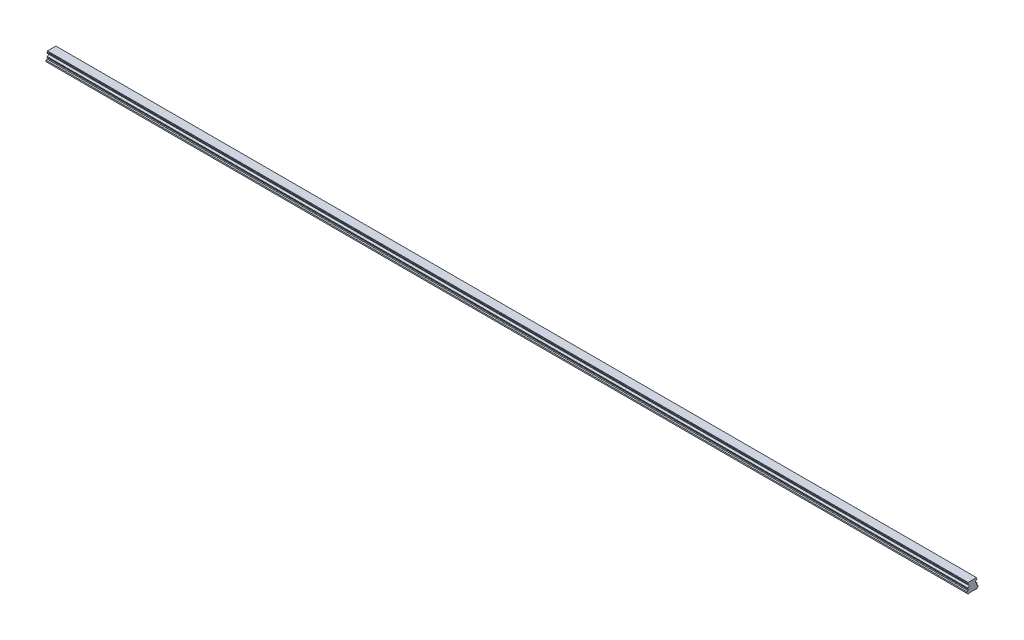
from build123d import *

# Parameters (mm, degrees)
BOSS_EXTRUDE1_DEPTH        = 2040
SKETCH3_R                  = 3
SKETCH3_R_2                = 2.5
CUT_EXTRUDE3_DEPTH         = 12
SKETCH3_2_R                = 2.5
CUT_EXTRUDE4_DEPTH         = 15
CHAMFER1_SIZE              = 0.5
LPATTERN4_COUNT            = 34
LPATTERN4_PITCH            = 60
CHAMFER1_OF_LPATTERN4_SIZE = 0.5


with BuildPart() as part:
    # Sketch1 → Boss-Extrude1 (new body)
    with BuildSketch(Plane(origin=(0, 0, 0), x_dir=(0, 0, -1), z_dir=(1, 0, 0))):
        with BuildLine():
            Line((9.375, 21.8), (-9.375, 21.8))
            Line((-9.375, 21.8), (-9.375, 20.756))
            Line((-9.375, 20.756), (-10, 19.415683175))
            Line((-10, 19.415683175), (-10, 17.685449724))
            ThreePointArc((-10, 17.685449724), (-7.2, 14.6), (-10, 11.514550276))
            Line((-10, 11.514550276), (-10, 9.784316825))
            Line((-10, 9.784316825), (-9.375, 8.444))
            Line((-9.375, 8.444), (-9.922688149, 6.4))
            Line((-9.922688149, 6.4), (-12.5, 5.489338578))
            Line((-12.5, 5.489338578), (-12.5, 2.65))
            Line((-12.5, 2.65), (-9.85, 0))
            Line((-9.85, 0), (-5.5, 0))
            Line((-5.5, 0), (-5, 0.5))
            Line((-5, 0.5), (5, 0.5))
            Line((5, 0.5), (5.5, 0))
            Line((5.5, 0), (9.85, 0))
            Line((9.85, 0), (12.5, 2.65))
            Line((12.5, 2.65), (12.5, 5.489338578))
            Line((12.5, 5.489338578), (9.922688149, 6.4))
            Line((9.922688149, 6.4), (9.375, 8.444))
            Line((9.375, 8.444), (10, 9.784316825))
            Line((10, 9.784316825), (10, 11.514550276))
            ThreePointArc((10, 11.514550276), (7.2, 14.6), (10, 17.685449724))
            Line((10, 17.685449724), (10, 19.415683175))
            Line((10, 19.415683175), (9.375, 20.756))
            Line((9.375, 20.756), (9.375, 21.8))
        make_face()
    extrude(amount=BOSS_EXTRUDE1_DEPTH)

    # Sketch3 → Cut-Extrude3 (cut)
    with BuildSketch(Plane.XZ):
        with Locations(Location((30, 0, 0), (0, 0, 270))):
            Circle(SKETCH3_R)
        with Locations(Location((30, 0, 0), (0, 0, 270))):
            Circle(SKETCH3_R_2, mode=Mode.SUBTRACT)
    cut_extrude3 = extrude(amount=-CUT_EXTRUDE3_DEPTH, mode=Mode.SUBTRACT)

    # Sketch3_2 → Cut-Extrude4 (cut)
    with BuildSketch(Plane.XZ):
        with Locations(Location((30, 0, 0), (0, 0, 270))):
            Circle(SKETCH3_2_R)
    cut_extrude4 = extrude(amount=-CUT_EXTRUDE4_DEPTH, mode=Mode.SUBTRACT)

    # Cut-Extrude5 cone 1 section (on through the dimple's axis) → Cut-Extrude5 (revolve, cut)
    with BuildSketch(Plane(origin=(30, 15, 0), x_dir=(0, 0, -1), z_dir=(1, 0, 0))):
        Polygon((0, 0), (2.5, 0), (0, 1.443375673), align=None)
    cut_extrude5 = revolve(axis=Axis((30, 15, 0), (0, 1, 0)), mode=Mode.SUBTRACT)

    # Chamfer1
    chamfer1_edges = [part.edges().sort_by_distance(p)[0] for p in [
        (30, 0.5, 3),
    ]]
    chamfer(chamfer1_edges, length=CHAMFER1_SIZE)

    # LPattern4: Cut-Extrude3, Cut-Extrude4, Cut-Extrude5 ×34
    with Locations(*[(i * LPATTERN4_PITCH, 0, 0) for i in range(1, LPATTERN4_COUNT)]):
        add(cut_extrude3, mode=Mode.SUBTRACT)
        add(cut_extrude4, mode=Mode.SUBTRACT)
        add(cut_extrude5, mode=Mode.SUBTRACT)

    # Chamfer1 of LPattern4
    chamfer1_of_lpattern4_edges = [part.edges().sort_by_distance(p)[0] for p in [
        (90, 0.5, 3),
        (150, 0.5, 3),
        (210, 0.5, 3),
        (270, 0.5, 3),
        (330, 0.5, 3),
        (390, 0.5, 3),
        (450, 0.5, 3),
        (510, 0.5, 3),
        (570, 0.5, 3),
        (630, 0.5, 3),
        (690, 0.5, 3),
        (750, 0.5, 3),
        (810, 0.5, 3),
        (870, 0.5, 3),
        (930, 0.5, 3),
        (990, 0.5, 3),
        (1050, 0.5, 3),
        (1110, 0.5, 3),
        (1170, 0.5, 3),
        (1230, 0.5, 3),
        (1290, 0.5, 3),
        (1350, 0.5, 3),
        (1410, 0.5, 3),
        (1470, 0.5, 3),
        (1530, 0.5, 3),
        (1590, 0.5, 3),
        (1650, 0.5, 3),
        (1710, 0.5, 3),
        (1770, 0.5, 3),
        (1830, 0.5, 3),
        (1890, 0.5, 3),
        (1950, 0.5, 3),
        (2010, 0.5, 3),
    ]]
    chamfer(chamfer1_of_lpattern4_edges, length=CHAMFER1_OF_LPATTERN4_SIZE)


solid = part.part
